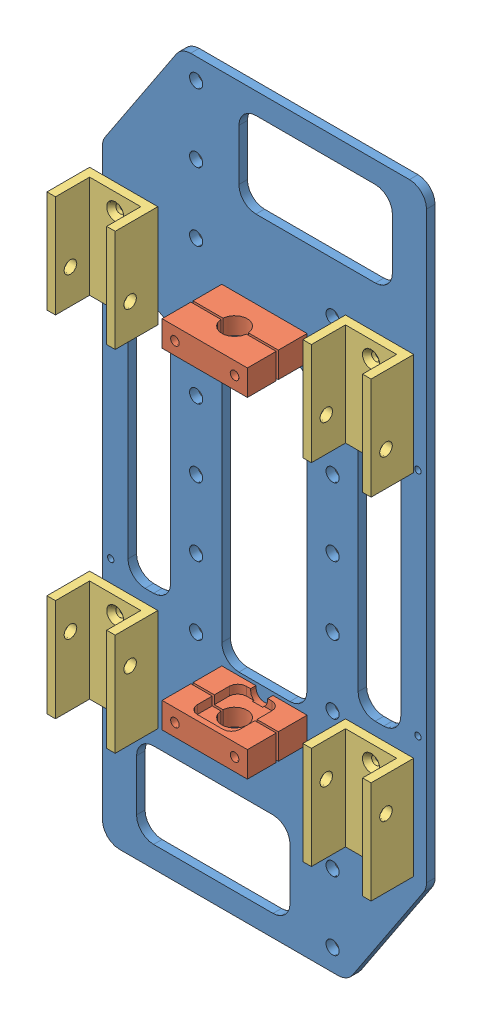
SolidWorks assembly NISKIN MOUNT ASSY.SLDASM, configuration Default (file format 12000). Lengths in mm.
Overall size (241.3 539.75 50.8).
7 component instances, 3 part files, 25 mates.
Components (placement in the parent):
- niskin bottle mount-1: niskin bottle mount.SLDPRT [Default] at origin size (241.3 539.75 6.35)
- niskin ram holder-1: niskin ram holder.SLDPRT [Default] at (120.65 146.8438 28.575) x (1 0 0) z (0 1 0) size (63.5 44.45 19.05)
- niskin ram holder-2: niskin ram holder.SLDPRT [Default] at (120.65 392.9062 28.575) x (-1 0 0) z (0 -1 0) size (63.5 44.45 19.05)
- nisking mount channel-1: nisking mount channel.SLDPRT [Default] at (25.4 139.7 15.875) x (-1 0 0) z (0 1 0) size (50.8 31.75 76.2)
- nisking mount channel-6: nisking mount channel.SLDPRT [Default] at (25.4 400.05 15.875) x (1 0 0) z (0 -1 0) size (50.8 31.75 76.2)
- nisking mount channel-7: nisking mount channel.SLDPRT [Default] at (215.9 400.05 15.875) x (1 0 0) z (0 -1 0) size (50.8 31.75 76.2)
- nisking mount channel-8: nisking mount channel.SLDPRT [Default] at (215.9 139.7 15.875) x (-1 0 0) z (0 1 0) size (50.8 31.75 76.2)
Mates (geometry in assembly coordinates):
- Coincident1: coordinate: point of niskin bottle mount-1
- Coincident2: coincident anti-aligned: plane of niskin bottle mount-1 through (0 0 6.35) normal (0 0 1); plane of niskin ram holder-1 through (152.4 156.3688 6.35) normal (0 0 -1)
- Parallel1: parallel aligned: plane of niskin bottle mount-1 through (241.3 539.75 6.35) normal (1 0 0); plane of niskin ram holder-1 through (152.4 156.3688 6.35) normal (1 0 0)
- Distance1: distance = 88.9 mm: plane of niskin ram holder-1 through (88.9 156.3688 6.35) normal (-1 0 0); line of niskin bottle mount-1 through (450.85 0 0) axis (0 0 1)
- Distance2: distance = 239.7125 mm anti-aligned: plane of niskin ram holder-2 through (130.175 389.7312 16.6751) normal (0 -1 0); plane of niskin ram holder-1 through (111.125 150.0188 16.6751) normal (0 1 0)
- Distance5: distance = 9.525 mm anti-aligned: plane of niskin bottle mount-1 through (0 0 6.35) normal (0 0 1); plane of nisking mount channel-1 through (0 177.8 15.875) normal (0 0 -1)
- Coincident5: coincident aligned: plane of niskin bottle mount-1 through (0 0 6.35) normal (-1 0 0); plane of nisking mount channel-1 through (0 177.8 15.875) normal (-1 0 0)
- Distance3: distance = 117.475 mm: cylinder of nisking mount channel-1 through (0 147.6375 36.5125) axis (-1 0 0) radius 4.7625
- Concentric2: concentric: cylinder of nisking mount channel-1 through (0 152.4 36.5125) axis (-1 0 0) radius 4.7625; cylinder of nisking mount channel-3 through (190.5 106.4499 29.1215) axis (-1 0 0) radius 4.7625
- Coincident8: coincident aligned: plane of nisking mount channel-1 through (0 177.8 15.875) normal (-1 0 0); plane of nisking mount channel-6 through (0 361.95 15.875) normal (-1 0 0)
- Coincident9: coincident anti-aligned: plane of niskin bottle mount-1 through (0 0 6.35) normal (0 0 1); plane of nisking mount channel-6 through (50.8 366.5269 6.35) normal (0 0 -1)
- Concentric3: concentric aligned: cylinder of nisking mount channel-6 through (50.8 387.35 36.5125) axis (1 0 0) radius 4.7625; cylinder of nisking mount channel-7 through (241.3 387.35 36.5125) axis (1 0 0) radius 4.7625
- Distance6: distance = 9.525 mm: plane of niskin bottle mount-1 through (0 0 6.35) normal (0 0 1); plane of nisking mount channel-7 through (241.3 371.5131 15.875) normal (0 0 -1)
- Coincident11: coincident aligned: plane of niskin bottle mount-1 through (241.3 539.75 6.35) normal (1 0 0); plane of nisking mount channel-7 through (241.3 361.95 15.875) normal (1 0 0)
- Distance4: distance = 234.95 mm: cylinder of nisking mount channel-1 through (0 152.4 36.5125) axis (-1 0 0) radius 4.7625; cylinder of nisking mount channel-6 through (50.8 396.875 36.5125) axis (1 0 0) radius 4.7625
- Coincident12: coincident aligned: plane of nisking mount channel-1 through (0 177.8 15.875) normal (0 0 -1); plane of nisking mount channel-6 through (50.8 361.95 15.875) normal (0 0 -1)
- Coincident13: coincident aligned: plane of nisking mount channel-6 through (50.8 361.95 15.875) normal (0 0 -1); plane of nisking mount channel-7 through (241.3 361.95 15.875) normal (0 0 -1)
- Coincident17: coincident aligned: plane of nisking mount channel-3 through (241.3 129.9557 6.35) normal (1 0 0); plane of nisking mount channel-7 through (241.3 361.95 15.875) normal (1 0 0)
- Coincident18: coincident: plane of niskin bottle mount-1 through (0 0 6.35) normal (0 0 1); plane of nisking mount channel-3 through (190.5 129.9557 6.35) normal (0 -0.087105 -0.996199)
- Concentric4: concentric: cylinder of nisking mount channel-1 through (0 152.4 36.5125) axis (-1 0 0) radius 4.7625; circle of nisking mount channel-3
- Concentric5: concentric aligned: cylinder of nisking mount channel-1 through (0 152.4 36.5125) axis (-1 0 0) radius 4.7625; cylinder of nisking mount channel-8 through (190.5 152.4 36.5125) axis (-1 0 0) radius 4.7625
- Coincident19: coincident aligned: plane of nisking mount channel-1 through (0 177.8 15.875) normal (0 0 -1); plane of nisking mount channel-8 through (190.5 177.8 15.875) normal (0 0 -1)
- Coincident20: coincident aligned: plane of niskin bottle mount-1 through (241.3 539.75 6.35) normal (1 0 0); plane of nisking mount channel-8 through (241.3 177.8 15.875) normal (1 0 0)
- Coincident21: coincident aligned: plane of niskin bottle mount-1 through (19.05 177.8 6.35) normal (0 1 0); plane of nisking mount channel-1 through (25.4 177.8 15.875) normal (0 1 0)
- Coincident22: coincident aligned: plane of niskin bottle mount-1 through (50.8 361.95 6.35) normal (0 -1 0); plane of nisking mount channel-6 through (25.4 361.95 15.875) normal (0 -1 0)
